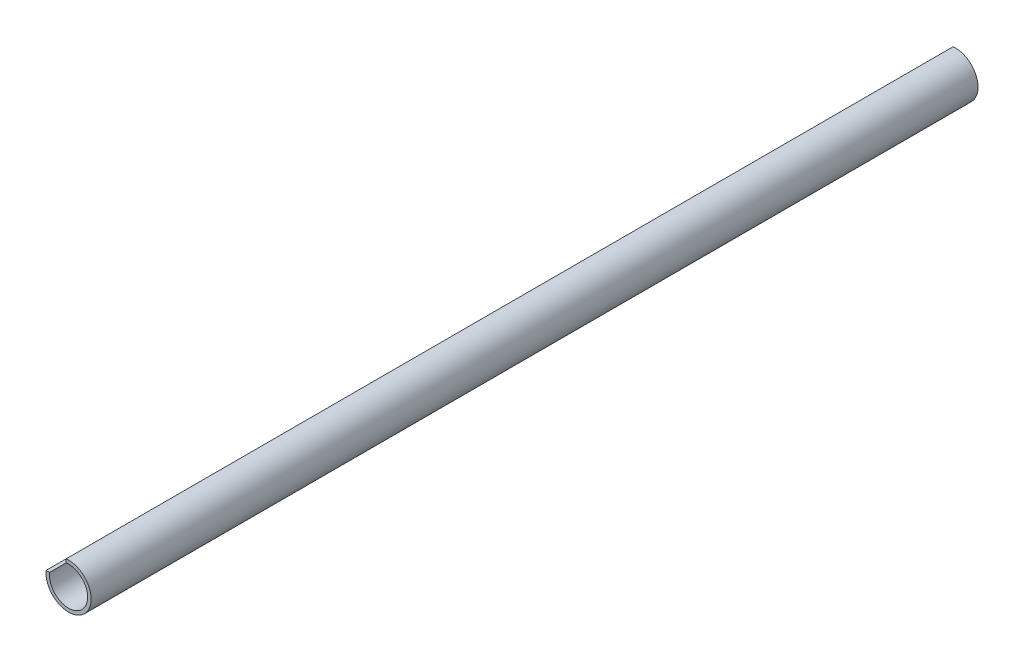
ISO-10303-21;
HEADER;
FILE_DESCRIPTION(('STEP AP214'),'2;1');
FILE_NAME('part.step','',(''),(''),'','','');
FILE_SCHEMA(('AUTOMOTIVE_DESIGN { 1 0 10303 214 1 1 1 1 }'));
ENDSEC;
DATA;
#1=APPLICATION_CONTEXT('core data for automotive mechanical design processes');
#2=APPLICATION_PROTOCOL_DEFINITION('international standard','automotive_design',2000,#1);
#3=PRODUCT_CONTEXT('',#1,'mechanical');
#4=PRODUCT('Part','Part','',(#3));
#5=PRODUCT_RELATED_PRODUCT_CATEGORY('part','',(#4));
#6=PRODUCT_DEFINITION_FORMATION('','',#4);
#7=PRODUCT_DEFINITION_CONTEXT('part definition',#1,'design');
#8=PRODUCT_DEFINITION('design','',#6,#7);
#9=PRODUCT_DEFINITION_SHAPE('','',#8);
#10=(LENGTH_UNIT() NAMED_UNIT(*) SI_UNIT(.MILLI.,.METRE.));
#11=(NAMED_UNIT(*) PLANE_ANGLE_UNIT() SI_UNIT($,.RADIAN.));
#12=(NAMED_UNIT(*) SI_UNIT($,.STERADIAN.) SOLID_ANGLE_UNIT());
#13=UNCERTAINTY_MEASURE_WITH_UNIT(LENGTH_MEASURE(1.E-05),#10,'distance_accuracy_value','');
#14=(GEOMETRIC_REPRESENTATION_CONTEXT(3) GLOBAL_UNCERTAINTY_ASSIGNED_CONTEXT((#13)) GLOBAL_UNIT_ASSIGNED_CONTEXT((#10,
#11,#12)) REPRESENTATION_CONTEXT('',''));
#15=CARTESIAN_POINT('',(0.,0.,0.));
#16=DIRECTION('',(0.,0.,1.));
#17=DIRECTION('',(1.,0.,0.));
#18=AXIS2_PLACEMENT_3D('',#15,#16,#17);
#19=CARTESIAN_POINT('',(0.,0.,511.175));
#20=DIRECTION('',(0.,0.,1.));
#21=DIRECTION('',(1.,0.,0.));
#22=AXIS2_PLACEMENT_3D('',#19,#20,#21);
#23=PLANE('',#22);
#24=DIRECTION('',(1.,0.,0.));
#25=VECTOR('',#24,1.);
#26=CARTESIAN_POINT('',(-1.41421356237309,1.4142135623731,511.175));
#27=LINE('',#26,#25);
#28=CARTESIAN_POINT('',(-12.9228479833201,1.4142135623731,511.175));
#29=VERTEX_POINT('',#28);
#30=CARTESIAN_POINT('',(-10.9087121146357,1.4142135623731,511.175));
#31=VERTEX_POINT('',#30);
#32=EDGE_CURVE('E51',#29,#31,#27,.T.);
#33=ORIENTED_EDGE('',*,*,#32,.F.);
#34=CARTESIAN_POINT('',(0.,0.,511.175));
#35=DIRECTION('',(0.,0.,1.));
#36=DIRECTION('',(1.,0.,0.));
#37=AXIS2_PLACEMENT_3D('',#34,#35,#36);
#38=CIRCLE('',#37,13.);
#39=CARTESIAN_POINT('',(-1.41421356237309,12.9228479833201,511.175));
#40=VERTEX_POINT('',#39);
#41=EDGE_CURVE('E82',#29,#40,#38,.T.);
#42=ORIENTED_EDGE('',*,*,#41,.T.);
#43=DIRECTION('',(0.,1.,0.));
#44=VECTOR('',#43,1.);
#45=CARTESIAN_POINT('',(-1.41421356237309,1.4142135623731,511.175));
#46=LINE('',#45,#44);
#47=CARTESIAN_POINT('',(-1.41421356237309,10.9087121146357,511.175));
#48=VERTEX_POINT('',#47);
#49=EDGE_CURVE('E85',#48,#40,#46,.T.);
#50=ORIENTED_EDGE('',*,*,#49,.F.);
#51=CARTESIAN_POINT('',(0.,0.,511.175));
#52=DIRECTION('',(0.,0.,1.));
#53=DIRECTION('',(1.,0.,0.));
#54=AXIS2_PLACEMENT_3D('',#51,#52,#53);
#55=CIRCLE('',#54,11.);
#56=EDGE_CURVE('E84',#31,#48,#55,.T.);
#57=ORIENTED_EDGE('',*,*,#56,.F.);
#58=EDGE_LOOP('',(#33,#42,#50,#57));
#59=FACE_BOUND('',#58,.T.);
#60=ADVANCED_FACE('F29',(#59),#23,.T.);
#61=CARTESIAN_POINT('',(0.,0.,0.));
#62=DIRECTION('',(0.,0.,1.));
#63=DIRECTION('',(1.,0.,0.));
#64=AXIS2_PLACEMENT_3D('',#61,#62,#63);
#65=PLANE('',#64);
#66=CARTESIAN_POINT('',(0.,0.,0.));
#67=DIRECTION('',(0.,0.,1.));
#68=DIRECTION('',(1.,0.,0.));
#69=AXIS2_PLACEMENT_3D('',#66,#67,#68);
#70=CIRCLE('',#69,13.);
#71=CARTESIAN_POINT('',(-12.9228479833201,1.4142135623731,0.));
#72=VERTEX_POINT('',#71);
#73=CARTESIAN_POINT('',(-1.41421356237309,12.9228479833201,0.));
#74=VERTEX_POINT('',#73);
#75=EDGE_CURVE('E88',#72,#74,#70,.T.);
#76=ORIENTED_EDGE('',*,*,#75,.F.);
#77=DIRECTION('',(1.,0.,0.));
#78=VECTOR('',#77,1.);
#79=CARTESIAN_POINT('',(-1.41421356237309,1.4142135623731,0.));
#80=LINE('',#79,#78);
#81=CARTESIAN_POINT('',(-10.9087121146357,1.4142135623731,0.));
#82=VERTEX_POINT('',#81);
#83=EDGE_CURVE('E70',#72,#82,#80,.T.);
#84=ORIENTED_EDGE('',*,*,#83,.T.);
#85=CARTESIAN_POINT('',(0.,0.,0.));
#86=DIRECTION('',(0.,0.,1.));
#87=DIRECTION('',(1.,0.,0.));
#88=AXIS2_PLACEMENT_3D('',#85,#86,#87);
#89=CIRCLE('',#88,11.);
#90=CARTESIAN_POINT('',(-1.41421356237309,10.9087121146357,0.));
#91=VERTEX_POINT('',#90);
#92=EDGE_CURVE('E75',#82,#91,#89,.T.);
#93=ORIENTED_EDGE('',*,*,#92,.T.);
#94=DIRECTION('',(0.,1.,0.));
#95=VECTOR('',#94,1.);
#96=CARTESIAN_POINT('',(-1.41421356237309,1.4142135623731,0.));
#97=LINE('',#96,#95);
#98=EDGE_CURVE('E44',#91,#74,#97,.T.);
#99=ORIENTED_EDGE('',*,*,#98,.T.);
#100=EDGE_LOOP('',(#76,#84,#93,#99));
#101=FACE_BOUND('',#100,.T.);
#102=ADVANCED_FACE('F103',(#101),#65,.F.);
#103=CARTESIAN_POINT('',(0.,0.,511.175));
#104=DIRECTION('',(0.,0.,-1.));
#105=DIRECTION('',(-1.,0.,0.));
#106=AXIS2_PLACEMENT_3D('',#103,#104,#105);
#107=CYLINDRICAL_SURFACE('',#106,13.);
#108=ORIENTED_EDGE('',*,*,#41,.F.);
#109=DIRECTION('',(0.,0.,-1.));
#110=VECTOR('',#109,1.);
#111=CARTESIAN_POINT('',(-12.9228479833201,1.4142135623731,511.175));
#112=LINE('',#111,#110);
#113=EDGE_CURVE('E67',#29,#72,#112,.T.);
#114=ORIENTED_EDGE('',*,*,#113,.T.);
#115=ORIENTED_EDGE('',*,*,#75,.T.);
#116=DIRECTION('',(0.,0.,-1.));
#117=VECTOR('',#116,1.);
#118=CARTESIAN_POINT('',(-1.41421356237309,12.9228479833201,511.175));
#119=LINE('',#118,#117);
#120=EDGE_CURVE('E76',#74,#40,#119,.F.);
#121=ORIENTED_EDGE('',*,*,#120,.T.);
#122=EDGE_LOOP('',(#108,#114,#115,#121));
#123=FACE_BOUND('',#122,.T.);
#124=ADVANCED_FACE('F31',(#123),#107,.T.);
#125=CARTESIAN_POINT('',(0.,0.,511.175));
#126=DIRECTION('',(0.,0.,-1.));
#127=DIRECTION('',(-1.,0.,0.));
#128=AXIS2_PLACEMENT_3D('',#125,#126,#127);
#129=CYLINDRICAL_SURFACE('',#128,11.);
#130=DIRECTION('',(0.,0.,-1.));
#131=VECTOR('',#130,1.);
#132=CARTESIAN_POINT('',(-10.9087121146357,1.4142135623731,511.175));
#133=LINE('',#132,#131);
#134=EDGE_CURVE('E11',#31,#82,#133,.T.);
#135=ORIENTED_EDGE('',*,*,#134,.F.);
#136=ORIENTED_EDGE('',*,*,#56,.T.);
#137=DIRECTION('',(0.,0.,-1.));
#138=VECTOR('',#137,1.);
#139=CARTESIAN_POINT('',(-1.41421356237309,10.9087121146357,511.175));
#140=LINE('',#139,#138);
#141=EDGE_CURVE('E37',#91,#48,#140,.F.);
#142=ORIENTED_EDGE('',*,*,#141,.F.);
#143=ORIENTED_EDGE('',*,*,#92,.F.);
#144=EDGE_LOOP('',(#135,#136,#142,#143));
#145=FACE_BOUND('',#144,.T.);
#146=ADVANCED_FACE('F100',(#145),#129,.F.);
#147=CARTESIAN_POINT('',(-1.41421356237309,1.4142135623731,0.));
#148=DIRECTION('',(1.,0.,0.));
#149=DIRECTION('',(0.,1.,0.));
#150=AXIS2_PLACEMENT_3D('',#147,#148,#149);
#151=PLANE('',#150);
#152=ORIENTED_EDGE('',*,*,#98,.F.);
#153=ORIENTED_EDGE('',*,*,#141,.T.);
#154=ORIENTED_EDGE('',*,*,#49,.T.);
#155=ORIENTED_EDGE('',*,*,#120,.F.);
#156=EDGE_LOOP('',(#152,#153,#154,#155));
#157=FACE_BOUND('',#156,.T.);
#158=ADVANCED_FACE('F98',(#157),#151,.F.);
#159=CARTESIAN_POINT('',(-1.41421356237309,1.4142135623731,0.));
#160=DIRECTION('',(0.,-1.,0.));
#161=DIRECTION('',(1.,0.,0.));
#162=AXIS2_PLACEMENT_3D('',#159,#160,#161);
#163=PLANE('',#162);
#164=ORIENTED_EDGE('',*,*,#32,.T.);
#165=ORIENTED_EDGE('',*,*,#134,.T.);
#166=ORIENTED_EDGE('',*,*,#83,.F.);
#167=ORIENTED_EDGE('',*,*,#113,.F.);
#168=EDGE_LOOP('',(#164,#165,#166,#167));
#169=FACE_BOUND('',#168,.T.);
#170=ADVANCED_FACE('F68',(#169),#163,.F.);
#171=CLOSED_SHELL('',(#60,#102,#124,#146,#158,#170));
#172=MANIFOLD_SOLID_BREP('B2',#171);
#173=ADVANCED_BREP_SHAPE_REPRESENTATION('',(#18,#172),#14);
#174=SHAPE_DEFINITION_REPRESENTATION(#9,#173);
ENDSEC;
END-ISO-10303-21;
